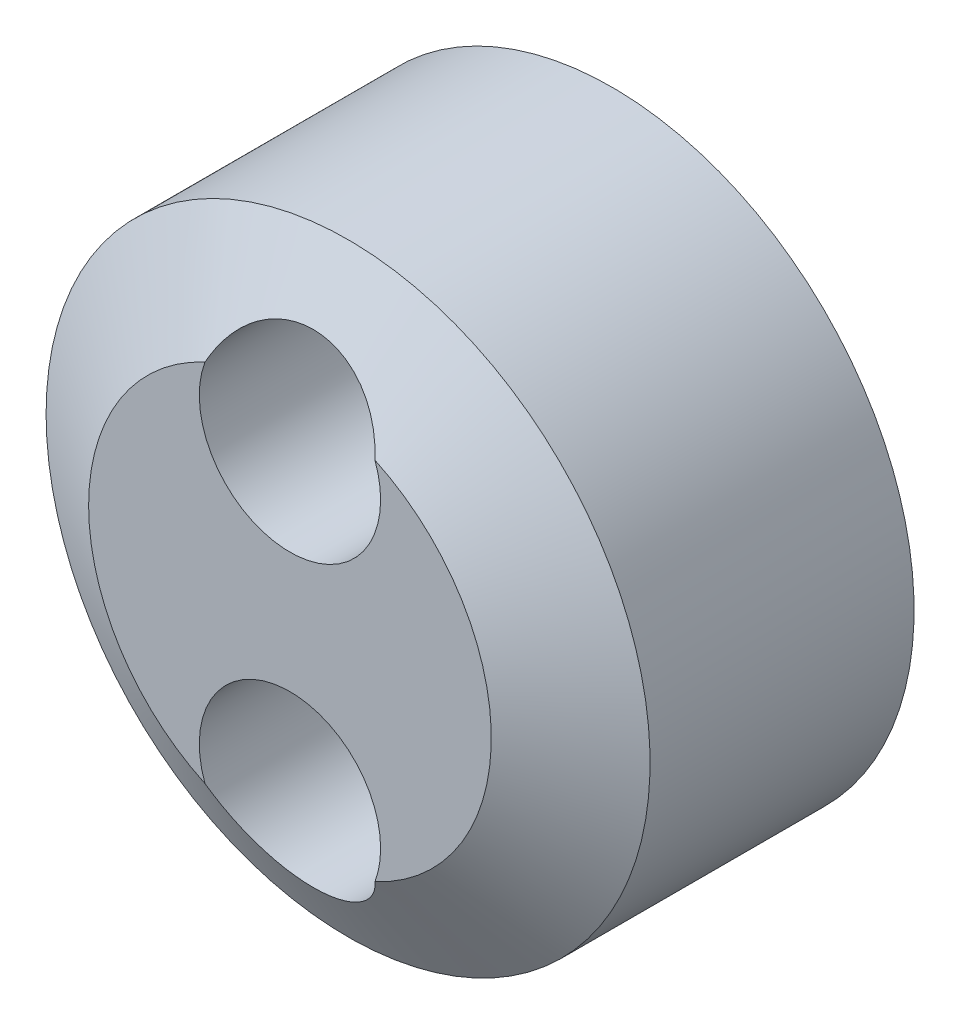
ISO-10303-21;
HEADER;
FILE_DESCRIPTION(('STEP AP214'),'2;1');
FILE_NAME('part.step','',(''),(''),'','','');
FILE_SCHEMA(('AUTOMOTIVE_DESIGN { 1 0 10303 214 1 1 1 1 }'));
ENDSEC;
DATA;
#1=APPLICATION_CONTEXT('core data for automotive mechanical design processes');
#2=APPLICATION_PROTOCOL_DEFINITION('international standard','automotive_design',2000,#1);
#3=PRODUCT_CONTEXT('',#1,'mechanical');
#4=PRODUCT('Part','Part','',(#3));
#5=PRODUCT_RELATED_PRODUCT_CATEGORY('part','',(#4));
#6=PRODUCT_DEFINITION_FORMATION('','',#4);
#7=PRODUCT_DEFINITION_CONTEXT('part definition',#1,'design');
#8=PRODUCT_DEFINITION('design','',#6,#7);
#9=PRODUCT_DEFINITION_SHAPE('','',#8);
#10=(LENGTH_UNIT() NAMED_UNIT(*) SI_UNIT(.MILLI.,.METRE.));
#11=(NAMED_UNIT(*) PLANE_ANGLE_UNIT() SI_UNIT($,.RADIAN.));
#12=(NAMED_UNIT(*) SI_UNIT($,.STERADIAN.) SOLID_ANGLE_UNIT());
#13=UNCERTAINTY_MEASURE_WITH_UNIT(LENGTH_MEASURE(1.E-05),#10,'distance_accuracy_value','');
#14=(GEOMETRIC_REPRESENTATION_CONTEXT(3) GLOBAL_UNCERTAINTY_ASSIGNED_CONTEXT((#13)) GLOBAL_UNIT_ASSIGNED_CONTEXT((#10,
#11,#12)) REPRESENTATION_CONTEXT('',''));
#15=CARTESIAN_POINT('',(0.,0.,0.));
#16=DIRECTION('',(0.,0.,1.));
#17=DIRECTION('',(1.,0.,0.));
#18=AXIS2_PLACEMENT_3D('',#15,#16,#17);
#19=CARTESIAN_POINT('',(0.,0.,32.));
#20=DIRECTION('',(0.,0.,-0.999999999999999));
#21=DIRECTION('',(-1.,0.,0.));
#22=AXIS2_PLACEMENT_3D('',#19,#20,#21);
#23=CYLINDRICAL_SURFACE('',#22,30.);
#24=CARTESIAN_POINT('',(0.,0.,26.2264973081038));
#25=DIRECTION('',(0.,0.,0.999999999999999));
#26=DIRECTION('',(1.,0.,0.));
#27=AXIS2_PLACEMENT_3D('',#24,#25,#26);
#28=CIRCLE('',#27,30.);
#29=CARTESIAN_POINT('',(-30.,0.,26.2264973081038));
#30=VERTEX_POINT('',#29);
#31=EDGE_CURVE('E11',#30,#30,#28,.F.);
#32=CARTESIAN_POINT('',(0.,0.,0.));
#33=DIRECTION('',(0.,0.,0.999999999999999));
#34=DIRECTION('',(1.,0.,0.));
#35=AXIS2_PLACEMENT_3D('',#32,#33,#34);
#36=CIRCLE('',#35,30.);
#37=CARTESIAN_POINT('',(-30.,0.,0.));
#38=VERTEX_POINT('',#37);
#39=EDGE_CURVE('E90',#38,#38,#36,.T.);
#40=CARTESIAN_POINT('',(-30.,0.,26.2264973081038));
#41=CARTESIAN_POINT('',(-30.,0.,25.953304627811));
#42=CARTESIAN_POINT('',(-30.,0.,25.6801119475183));
#43=CARTESIAN_POINT('',(-30.,0.,25.1337265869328));
#44=CARTESIAN_POINT('',(-30.,0.,24.86053390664));
#45=CARTESIAN_POINT('',(-30.,0.,24.3141485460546));
#46=CARTESIAN_POINT('',(-30.,0.,24.0409558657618));
#47=CARTESIAN_POINT('',(-30.,0.,23.4945705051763));
#48=CARTESIAN_POINT('',(-30.,0.,23.2213778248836));
#49=CARTESIAN_POINT('',(-30.,0.,22.6749924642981));
#50=CARTESIAN_POINT('',(-30.,0.,22.4017997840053));
#51=CARTESIAN_POINT('',(-30.,0.,21.8554144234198));
#52=CARTESIAN_POINT('',(-30.,0.,21.5822217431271));
#53=CARTESIAN_POINT('',(-30.,0.,21.0358363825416));
#54=CARTESIAN_POINT('',(-30.,0.,20.7626437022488));
#55=CARTESIAN_POINT('',(-30.,0.,20.2162583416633));
#56=CARTESIAN_POINT('',(-30.,0.,19.9430656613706));
#57=CARTESIAN_POINT('',(-30.,0.,19.3966803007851));
#58=CARTESIAN_POINT('',(-30.,0.,19.1234876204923));
#59=CARTESIAN_POINT('',(-30.,0.,18.5771022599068));
#60=CARTESIAN_POINT('',(-30.,0.,18.3039095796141));
#61=CARTESIAN_POINT('',(-30.,0.,17.7575242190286));
#62=CARTESIAN_POINT('',(-30.,0.,17.4843315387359));
#63=CARTESIAN_POINT('',(-30.,0.,16.9379461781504));
#64=CARTESIAN_POINT('',(-30.,0.,16.6647534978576));
#65=CARTESIAN_POINT('',(-30.,0.,16.1183681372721));
#66=CARTESIAN_POINT('',(-30.,0.,15.8451754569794));
#67=CARTESIAN_POINT('',(-30.,0.,15.2987900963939));
#68=CARTESIAN_POINT('',(-30.,0.,15.0255974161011));
#69=CARTESIAN_POINT('',(-30.,0.,14.4792120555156));
#70=CARTESIAN_POINT('',(-30.,0.,14.2060193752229));
#71=CARTESIAN_POINT('',(-30.,0.,13.6596340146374));
#72=CARTESIAN_POINT('',(-30.,0.,13.3864413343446));
#73=CARTESIAN_POINT('',(-30.,0.,12.8400559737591));
#74=CARTESIAN_POINT('',(-30.,0.,12.5668632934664));
#75=CARTESIAN_POINT('',(-30.,0.,12.0204779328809));
#76=CARTESIAN_POINT('',(-30.,0.,11.7472852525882));
#77=CARTESIAN_POINT('',(-30.,0.,11.2008998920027));
#78=CARTESIAN_POINT('',(-30.,0.,10.9277072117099));
#79=CARTESIAN_POINT('',(-30.,0.,10.3813218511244));
#80=CARTESIAN_POINT('',(-30.,0.,10.1081291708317));
#81=CARTESIAN_POINT('',(-30.,0.,9.56174381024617));
#82=CARTESIAN_POINT('',(-30.,0.,9.28855112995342));
#83=CARTESIAN_POINT('',(-30.,0.,8.74216576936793));
#84=CARTESIAN_POINT('',(-30.,0.,8.46897308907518));
#85=CARTESIAN_POINT('',(-30.,0.,7.92258772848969));
#86=CARTESIAN_POINT('',(-30.,0.,7.64939504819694));
#87=CARTESIAN_POINT('',(-30.,0.,7.10300968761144));
#88=CARTESIAN_POINT('',(-30.,0.,6.82981700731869));
#89=CARTESIAN_POINT('',(-30.,0.,6.2834316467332));
#90=CARTESIAN_POINT('',(-30.,0.,6.01023896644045));
#91=CARTESIAN_POINT('',(-30.,0.,5.46385360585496));
#92=CARTESIAN_POINT('',(-30.,0.,5.19066092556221));
#93=CARTESIAN_POINT('',(-30.,0.,4.64427556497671));
#94=CARTESIAN_POINT('',(-30.,0.,4.37108288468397));
#95=CARTESIAN_POINT('',(-30.,0.,3.82469752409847));
#96=CARTESIAN_POINT('',(-30.,0.,3.55150484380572));
#97=CARTESIAN_POINT('',(-30.,0.,3.00511948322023));
#98=CARTESIAN_POINT('',(-30.,0.,2.73192680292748));
#99=CARTESIAN_POINT('',(-30.,0.,2.18554144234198));
#100=CARTESIAN_POINT('',(-30.,0.,1.91234876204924));
#101=CARTESIAN_POINT('',(-30.,0.,1.36596340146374));
#102=CARTESIAN_POINT('',(-30.,0.,1.092770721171));
#103=CARTESIAN_POINT('',(-30.,0.,0.546385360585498));
#104=CARTESIAN_POINT('',(-30.,0.,0.273192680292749));
#105=CARTESIAN_POINT('',(-30.,0.,0.));
#106=B_SPLINE_CURVE_WITH_KNOTS('',3,(#40,#41,#42,#43,#44,#45,#46,#47,#48,#49,#50,#51,#52,#53,
#54,#55,#56,#57,#58,#59,#60,#61,#62,#63,#64,#65,#66,#67,#68,#69,#70,#71,#72,#73,#74,#75,#76,#77,
#78,#79,#80,#81,#82,#83,#84,#85,#86,#87,#88,#89,#90,#91,#92,#93,#94,#95,#96,#97,#98,#99,#100,
#101,#102,#103,#104,#105),.UNSPECIFIED.,.F.,.F.,(4,2,2,2,2,2,2,2,2,2,2,2,2,2,2,2,2,2,2,2,2,2,2,
2,2,2,2,2,2,2,2,2,4),(0.,0.819578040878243,1.63915608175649,2.45873412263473,3.27831216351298,
4.09789020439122,4.91746824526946,5.7370462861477,6.55662432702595,7.37620236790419,
8.19578040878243,9.01535844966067,9.83493649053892,10.6545145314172,11.4740925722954,
12.2936706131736,13.1132486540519,13.9328266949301,14.7524047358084,15.5719827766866,
16.3915608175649,17.2111388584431,18.0307168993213,18.8502949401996,19.6698729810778,
20.4894510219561,21.3090290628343,22.1286071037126,22.9481851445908,23.7677631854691,
24.5873412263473,25.4069192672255,26.2264973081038),.UNSPECIFIED.);
#107=EDGE_CURVE('BSEAM34',#30,#38,#106,.T.);
#108=ORIENTED_EDGE('',*,*,#31,.T.);
#109=ORIENTED_EDGE('',*,*,#39,.T.);
#110=ORIENTED_EDGE('',*,*,#107,.T.);
#111=ORIENTED_EDGE('',*,*,#107,.F.);
#112=EDGE_LOOP('',(#108,#110,#109,#111));
#113=FACE_BOUND('',#112,.T.);
#114=ADVANCED_FACE('F34',(#113),#23,.T.);
#115=CARTESIAN_POINT('',(0.,0.,32.));
#116=DIRECTION('',(0.,0.,0.999999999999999));
#117=DIRECTION('',(1.,0.,0.));
#118=AXIS2_PLACEMENT_3D('',#115,#116,#117);
#119=PLANE('',#118);
#120=CARTESIAN_POINT('',(-3.5527136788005E-12,-14.9999999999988,32.));
#121=DIRECTION('',(0.,0.,0.999999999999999));
#122=DIRECTION('',(1.,0.,0.));
#123=AXIS2_PLACEMENT_3D('',#120,#121,#122);
#124=CIRCLE('',#123,9.005);
#125=CARTESIAN_POINT('',(8.44340236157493,-18.1303325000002,32.));
#126=VERTEX_POINT('',#125);
#127=CARTESIAN_POINT('',(-8.44340236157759,-18.1303324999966,32.));
#128=VERTEX_POINT('',#127);
#129=EDGE_CURVE('E70',#126,#128,#124,.T.);
#130=ORIENTED_EDGE('',*,*,#129,.F.);
#131=CARTESIAN_POINT('',(0.,0.,32.));
#132=DIRECTION('',(0.,0.,0.999999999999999));
#133=DIRECTION('',(1.,0.,0.));
#134=AXIS2_PLACEMENT_3D('',#131,#132,#133);
#135=CIRCLE('',#134,19.9999999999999);
#136=CARTESIAN_POINT('',(8.44340236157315,18.1303325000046,32.));
#137=VERTEX_POINT('',#136);
#138=EDGE_CURVE('E64',#126,#137,#135,.T.);
#139=ORIENTED_EDGE('',*,*,#138,.T.);
#140=CARTESIAN_POINT('',(0.,15.0000000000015,32.));
#141=DIRECTION('',(0.,0.,0.999999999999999));
#142=DIRECTION('',(1.,0.,0.));
#143=AXIS2_PLACEMENT_3D('',#140,#141,#142);
#144=CIRCLE('',#143,9.005);
#145=CARTESIAN_POINT('',(-8.4434023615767,18.1303325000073,32.));
#146=VERTEX_POINT('',#145);
#147=EDGE_CURVE('E69',#146,#137,#144,.T.);
#148=ORIENTED_EDGE('',*,*,#147,.F.);
#149=CARTESIAN_POINT('',(0.,0.,32.));
#150=DIRECTION('',(0.,0.,0.999999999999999));
#151=DIRECTION('',(1.,0.,0.));
#152=AXIS2_PLACEMENT_3D('',#149,#150,#151);
#153=CIRCLE('',#152,19.9999999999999);
#154=EDGE_CURVE('E53',#146,#128,#153,.T.);
#155=ORIENTED_EDGE('',*,*,#154,.T.);
#156=EDGE_LOOP('',(#130,#139,#148,#155));
#157=FACE_BOUND('',#156,.T.);
#158=ADVANCED_FACE('F68',(#157),#119,.T.);
#159=CARTESIAN_POINT('',(0.,0.,0.));
#160=DIRECTION('',(0.,0.,0.999999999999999));
#161=DIRECTION('',(1.,0.,0.));
#162=AXIS2_PLACEMENT_3D('',#159,#160,#161);
#163=PLANE('',#162);
#164=CARTESIAN_POINT('',(0.,15.0000000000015,0.));
#165=DIRECTION('',(0.,0.,0.999999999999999));
#166=DIRECTION('',(1.,0.,0.));
#167=AXIS2_PLACEMENT_3D('',#164,#165,#166);
#168=CIRCLE('',#167,4.49999999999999);
#169=CARTESIAN_POINT('',(4.5,15.0000000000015,0.));
#170=VERTEX_POINT('',#169);
#171=EDGE_CURVE('E150',#170,#170,#168,.T.);
#172=ORIENTED_EDGE('',*,*,#171,.T.);
#173=EDGE_LOOP('',(#172));
#174=FACE_BOUND('',#173,.T.);
#175=CARTESIAN_POINT('',(-3.5527136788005E-12,-14.9999999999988,0.));
#176=DIRECTION('',(0.,0.,0.999999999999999));
#177=DIRECTION('',(1.,0.,0.));
#178=AXIS2_PLACEMENT_3D('',#175,#176,#177);
#179=CIRCLE('',#178,4.49999999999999);
#180=CARTESIAN_POINT('',(4.49999999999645,-14.9999999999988,0.));
#181=VERTEX_POINT('',#180);
#182=EDGE_CURVE('E73',#181,#181,#179,.T.);
#183=ORIENTED_EDGE('',*,*,#182,.T.);
#184=EDGE_LOOP('',(#183));
#185=FACE_BOUND('',#184,.T.);
#186=ORIENTED_EDGE('',*,*,#39,.F.);
#187=EDGE_LOOP('',(#186));
#188=FACE_BOUND('',#187,.T.);
#189=ADVANCED_FACE('F121',(#174,#185,#188),#163,.F.);
#190=CARTESIAN_POINT('',(-3.5527136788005E-12,-14.9999999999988,32.));
#191=DIRECTION('',(0.,0.,0.999999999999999));
#192=DIRECTION('',(1.,0.,0.));
#193=AXIS2_PLACEMENT_3D('',#190,#191,#192);
#194=CYLINDRICAL_SURFACE('',#193,9.005);
#195=CARTESIAN_POINT('',(-3.5527136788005E-12,-14.9999999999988,10.));
#196=DIRECTION('',(0.,0.,0.999999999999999));
#197=DIRECTION('',(1.,0.,0.));
#198=AXIS2_PLACEMENT_3D('',#195,#196,#197);
#199=CIRCLE('',#198,9.005);
#200=CARTESIAN_POINT('',(9.00499999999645,-14.9999999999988,10.));
#201=VERTEX_POINT('',#200);
#202=EDGE_CURVE('E86',#201,#201,#199,.T.);
#203=ORIENTED_EDGE('',*,*,#202,.F.);
#204=EDGE_LOOP('',(#203));
#205=FACE_BOUND('',#204,.T.);
#206=ORIENTED_EDGE('',*,*,#129,.T.);
#207=CARTESIAN_POINT('',(-8.44340236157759,-18.1303324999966,32.));
#208=CARTESIAN_POINT('',(-8.35651866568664,-18.3647595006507,31.8984873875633));
#209=CARTESIAN_POINT('',(-8.25945803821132,-18.5965321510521,31.7994683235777));
#210=CARTESIAN_POINT('',(-8.04528145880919,-19.0530148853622,31.6067613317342));
#211=CARTESIAN_POINT('',(-7.92815906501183,-19.2777226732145,31.513075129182));
#212=CARTESIAN_POINT('',(-7.67393210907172,-19.7186572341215,31.3312422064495));
#213=CARTESIAN_POINT('',(-7.53678378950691,-19.9348640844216,31.243108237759));
#214=CARTESIAN_POINT('',(-7.2432906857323,-20.356369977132,31.0729947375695));
#215=CARTESIAN_POINT('',(-7.08694803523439,-20.5616702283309,30.9910145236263));
#216=CARTESIAN_POINT('',(-6.75541242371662,-20.9600118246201,30.833376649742));
#217=CARTESIAN_POINT('',(-6.5801738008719,-21.1530215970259,30.7577351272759));
#218=CARTESIAN_POINT('',(-6.21216689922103,-21.5243645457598,30.6133723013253));
#219=CARTESIAN_POINT('',(-6.01939918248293,-21.7026981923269,30.5446507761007));
#220=CARTESIAN_POINT('',(-5.61779350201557,-22.0426954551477,30.4145574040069));
#221=CARTESIAN_POINT('',(-5.40897500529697,-22.2043787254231,30.3531768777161));
#222=CARTESIAN_POINT('',(-4.97652117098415,-22.5096135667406,30.2380061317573));
#223=CARTESIAN_POINT('',(-4.75288681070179,-22.6531663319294,30.1842154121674));
#224=CARTESIAN_POINT('',(-4.30482702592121,-22.9134043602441,30.0872031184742));
#225=CARTESIAN_POINT('',(-4.08108748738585,-23.0311177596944,30.0435693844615));
#226=CARTESIAN_POINT('',(-3.62342688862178,-23.2477199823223,29.9636034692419));
#227=CARTESIAN_POINT('',(-3.38950641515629,-23.3466098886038,29.927270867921));
#228=CARTESIAN_POINT('',(-2.91318852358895,-23.524552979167,29.8621012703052));
#229=CARTESIAN_POINT('',(-2.67078998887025,-23.6036035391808,29.8332652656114));
#230=CARTESIAN_POINT('',(-2.1794248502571,-23.7410070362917,29.7832593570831));
#231=CARTESIAN_POINT('',(-1.9304584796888,-23.7993607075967,29.7620891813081));
#232=CARTESIAN_POINT('',(-1.44064117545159,-23.8923309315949,29.7284097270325));
#233=CARTESIAN_POINT('',(-1.20001525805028,-23.9279973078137,29.7155170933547));
#234=CARTESIAN_POINT('',(-0.716401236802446,-23.9797509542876,29.6968210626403));
#235=CARTESIAN_POINT('',(-0.473413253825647,-23.9958392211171,29.6910173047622));
#236=CARTESIAN_POINT('',(0.0130723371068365,-24.0082765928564,29.6865299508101));
#237=CARTESIAN_POINT('',(0.256569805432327,-24.0046305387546,29.6878446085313));
#238=CARTESIAN_POINT('',(0.742328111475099,-23.9776469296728,29.6975829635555));
#239=CARTESIAN_POINT('',(0.984588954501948,-23.9543094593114,29.7060066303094));
#240=CARTESIAN_POINT('',(1.46124068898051,-23.8888416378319,29.7296770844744));
#241=CARTESIAN_POINT('',(1.69569188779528,-23.8470984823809,29.7447833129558));
#242=CARTESIAN_POINT('',(2.16004701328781,-23.7453253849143,29.7817010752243));
#243=CARTESIAN_POINT('',(2.38995102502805,-23.6852957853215,29.8035124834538));
#244=CARTESIAN_POINT('',(2.84364129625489,-23.5475104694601,29.8537317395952));
#245=CARTESIAN_POINT('',(3.06742755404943,-23.4697547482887,29.8821395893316));
#246=CARTESIAN_POINT('',(3.50739751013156,-23.2972299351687,29.9454132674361));
#247=CARTESIAN_POINT('',(3.72358110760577,-23.2024606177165,29.9802791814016));
#248=CARTESIAN_POINT('',(4.14946468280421,-22.9955410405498,30.0567534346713));
#249=CARTESIAN_POINT('',(4.35905775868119,-22.8831984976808,30.0984366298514));
#250=CARTESIAN_POINT('',(4.7677297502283,-22.6429681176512,30.1880497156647));
#251=CARTESIAN_POINT('',(4.96680858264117,-22.5150801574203,30.2359796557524));
#252=CARTESIAN_POINT('',(5.35327621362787,-22.2448639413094,30.3378705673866));
#253=CARTESIAN_POINT('',(5.54066484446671,-22.102535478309,30.3918316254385));
#254=CARTESIAN_POINT('',(5.90278958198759,-21.8045652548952,30.5055753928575));
#255=CARTESIAN_POINT('',(6.07752000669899,-21.6489175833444,30.5653606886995));
#256=CARTESIAN_POINT('',(6.42018742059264,-21.3190236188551,30.6930377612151));
#257=CARTESIAN_POINT('',(6.58755760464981,-21.1442779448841,30.7611605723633));
#258=CARTESIAN_POINT('',(6.90661596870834,-20.7833110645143,30.9031075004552));
#259=CARTESIAN_POINT('',(7.05830988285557,-20.5970940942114,30.9769295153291));
#260=CARTESIAN_POINT('',(7.3453679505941,-20.2146663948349,31.1299797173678));
#261=CARTESIAN_POINT('',(7.48073635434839,-20.018458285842,31.2092064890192));
#262=CARTESIAN_POINT('',(7.73462694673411,-19.617558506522,31.3727588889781));
#263=CARTESIAN_POINT('',(7.85315471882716,-19.4128696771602,31.4570828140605));
#264=CARTESIAN_POINT('',(8.05542262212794,-19.0298009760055,31.6166523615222));
#265=CARTESIAN_POINT('',(8.14169415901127,-18.8524555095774,31.6911900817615));
#266=CARTESIAN_POINT('',(8.30181264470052,-18.4940527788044,31.8433173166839));
#267=CARTESIAN_POINT('',(8.37568656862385,-18.3130045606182,31.9208997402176));
#268=CARTESIAN_POINT('',(8.44340236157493,-18.1303325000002,32.));
#269=B_SPLINE_CURVE_WITH_KNOTS('',3,(#207,#208,#209,#210,#211,#212,#213,#214,#215,#216,#217,
#218,#219,#220,#221,#222,#223,#224,#225,#226,#227,#228,#229,#230,#231,#232,#233,#234,#235,#236,
#237,#238,#239,#240,#241,#242,#243,#244,#245,#246,#247,#248,#249,#250,#251,#252,#253,#254,#255,
#256,#257,#258,#259,#260,#261,#262,#263,#264,#265,#266,#267,#268),.UNSPECIFIED.,.F.,.F.,(4,2,2,
2,2,2,2,2,2,2,2,2,2,2,2,2,2,2,2,2,2,2,2,2,2,2,2,2,2,2,4),(0.,0.809332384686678,1.61892513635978,
2.43031411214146,3.24161297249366,4.05491822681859,4.86819741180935,5.68050532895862,
6.49275971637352,7.26144473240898,8.03008550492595,8.79882789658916,9.56754301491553,
10.2974416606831,11.0273031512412,11.7569856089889,12.4866649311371,13.2016765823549,
13.9166748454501,14.6316733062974,15.346681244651,16.0701443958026,16.7936132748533,
17.5170925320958,18.2408945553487,18.9941853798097,19.7471996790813,20.5000175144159,
21.2525851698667,21.8846689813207,22.5153591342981),.UNSPECIFIED.);
#270=EDGE_CURVE('E41',#128,#126,#269,.T.);
#271=ORIENTED_EDGE('',*,*,#270,.T.);
#272=EDGE_LOOP('',(#206,#271));
#273=FACE_BOUND('',#272,.T.);
#274=ADVANCED_FACE('F116',(#205,#273),#194,.F.);
#275=CARTESIAN_POINT('',(4.49999999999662,-14.9999999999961,10.));
#276=DIRECTION('',(0.,0.,-0.999999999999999));
#277=DIRECTION('',(-1.,0.,0.));
#278=AXIS2_PLACEMENT_3D('',#275,#276,#277);
#279=PLANE('',#278);
#280=CARTESIAN_POINT('',(-3.5527136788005E-12,-14.9999999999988,10.));
#281=DIRECTION('',(0.,0.,0.999999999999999));
#282=DIRECTION('',(1.,0.,0.));
#283=AXIS2_PLACEMENT_3D('',#280,#281,#282);
#284=CIRCLE('',#283,4.5);
#285=CARTESIAN_POINT('',(4.49999999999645,-14.9999999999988,10.));
#286=VERTEX_POINT('',#285);
#287=EDGE_CURVE('E77',#286,#286,#284,.T.);
#288=ORIENTED_EDGE('',*,*,#287,.F.);
#289=EDGE_LOOP('',(#288));
#290=FACE_BOUND('',#289,.T.);
#291=ORIENTED_EDGE('',*,*,#202,.T.);
#292=EDGE_LOOP('',(#291));
#293=FACE_BOUND('',#292,.T.);
#294=ADVANCED_FACE('F113',(#290,#293),#279,.F.);
#295=CARTESIAN_POINT('',(-3.5527136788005E-12,-14.9999999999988,32.));
#296=DIRECTION('',(0.,0.,0.999999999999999));
#297=DIRECTION('',(1.,0.,0.));
#298=AXIS2_PLACEMENT_3D('',#295,#296,#297);
#299=CYLINDRICAL_SURFACE('',#298,4.49999999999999);
#300=CARTESIAN_POINT('',(4.49999999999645,-14.9999999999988,0.));
#301=CARTESIAN_POINT('',(4.49999999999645,-14.9999999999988,0.104166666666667));
#302=CARTESIAN_POINT('',(4.49999999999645,-14.9999999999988,0.208333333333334));
#303=CARTESIAN_POINT('',(4.49999999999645,-14.9999999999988,0.416666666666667));
#304=CARTESIAN_POINT('',(4.49999999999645,-14.9999999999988,0.520833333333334));
#305=CARTESIAN_POINT('',(4.49999999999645,-14.9999999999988,0.729166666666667));
#306=CARTESIAN_POINT('',(4.49999999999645,-14.9999999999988,0.833333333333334));
#307=CARTESIAN_POINT('',(4.49999999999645,-14.9999999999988,1.04166666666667));
#308=CARTESIAN_POINT('',(4.49999999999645,-14.9999999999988,1.14583333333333));
#309=CARTESIAN_POINT('',(4.49999999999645,-14.9999999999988,1.35416666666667));
#310=CARTESIAN_POINT('',(4.49999999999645,-14.9999999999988,1.45833333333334));
#311=CARTESIAN_POINT('',(4.49999999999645,-14.9999999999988,1.66666666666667));
#312=CARTESIAN_POINT('',(4.49999999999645,-14.9999999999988,1.77083333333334));
#313=CARTESIAN_POINT('',(4.49999999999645,-14.9999999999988,1.97916666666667));
#314=CARTESIAN_POINT('',(4.49999999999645,-14.9999999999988,2.08333333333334));
#315=CARTESIAN_POINT('',(4.49999999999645,-14.9999999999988,2.29166666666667));
#316=CARTESIAN_POINT('',(4.49999999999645,-14.9999999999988,2.39583333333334));
#317=CARTESIAN_POINT('',(4.49999999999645,-14.9999999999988,2.60416666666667));
#318=CARTESIAN_POINT('',(4.49999999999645,-14.9999999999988,2.70833333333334));
#319=CARTESIAN_POINT('',(4.49999999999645,-14.9999999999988,2.91666666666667));
#320=CARTESIAN_POINT('',(4.49999999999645,-14.9999999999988,3.02083333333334));
#321=CARTESIAN_POINT('',(4.49999999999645,-14.9999999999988,3.22916666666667));
#322=CARTESIAN_POINT('',(4.49999999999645,-14.9999999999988,3.33333333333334));
#323=CARTESIAN_POINT('',(4.49999999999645,-14.9999999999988,3.54166666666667));
#324=CARTESIAN_POINT('',(4.49999999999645,-14.9999999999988,3.64583333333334));
#325=CARTESIAN_POINT('',(4.49999999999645,-14.9999999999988,3.85416666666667));
#326=CARTESIAN_POINT('',(4.49999999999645,-14.9999999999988,3.95833333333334));
#327=CARTESIAN_POINT('',(4.49999999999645,-14.9999999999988,4.16666666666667));
#328=CARTESIAN_POINT('',(4.49999999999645,-14.9999999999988,4.27083333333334));
#329=CARTESIAN_POINT('',(4.49999999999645,-14.9999999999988,4.47916666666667));
#330=CARTESIAN_POINT('',(4.49999999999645,-14.9999999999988,4.58333333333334));
#331=CARTESIAN_POINT('',(4.49999999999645,-14.9999999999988,4.79166666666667));
#332=CARTESIAN_POINT('',(4.49999999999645,-14.9999999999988,4.89583333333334));
#333=CARTESIAN_POINT('',(4.49999999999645,-14.9999999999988,5.10416666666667));
#334=CARTESIAN_POINT('',(4.49999999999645,-14.9999999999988,5.20833333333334));
#335=CARTESIAN_POINT('',(4.49999999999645,-14.9999999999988,5.41666666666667));
#336=CARTESIAN_POINT('',(4.49999999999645,-14.9999999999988,5.52083333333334));
#337=CARTESIAN_POINT('',(4.49999999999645,-14.9999999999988,5.72916666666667));
#338=CARTESIAN_POINT('',(4.49999999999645,-14.9999999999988,5.83333333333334));
#339=CARTESIAN_POINT('',(4.49999999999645,-14.9999999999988,6.04166666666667));
#340=CARTESIAN_POINT('',(4.49999999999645,-14.9999999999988,6.14583333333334));
#341=CARTESIAN_POINT('',(4.49999999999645,-14.9999999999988,6.35416666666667));
#342=CARTESIAN_POINT('',(4.49999999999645,-14.9999999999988,6.45833333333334));
#343=CARTESIAN_POINT('',(4.49999999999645,-14.9999999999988,6.66666666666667));
#344=CARTESIAN_POINT('',(4.49999999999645,-14.9999999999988,6.77083333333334));
#345=CARTESIAN_POINT('',(4.49999999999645,-14.9999999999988,6.97916666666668));
#346=CARTESIAN_POINT('',(4.49999999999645,-14.9999999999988,7.08333333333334));
#347=CARTESIAN_POINT('',(4.49999999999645,-14.9999999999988,7.29166666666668));
#348=CARTESIAN_POINT('',(4.49999999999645,-14.9999999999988,7.39583333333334));
#349=CARTESIAN_POINT('',(4.49999999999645,-14.9999999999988,7.60416666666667));
#350=CARTESIAN_POINT('',(4.49999999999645,-14.9999999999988,7.70833333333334));
#351=CARTESIAN_POINT('',(4.49999999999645,-14.9999999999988,7.91666666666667));
#352=CARTESIAN_POINT('',(4.49999999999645,-14.9999999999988,8.02083333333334));
#353=CARTESIAN_POINT('',(4.49999999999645,-14.9999999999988,8.22916666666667));
#354=CARTESIAN_POINT('',(4.49999999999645,-14.9999999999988,8.33333333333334));
#355=CARTESIAN_POINT('',(4.49999999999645,-14.9999999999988,8.54166666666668));
#356=CARTESIAN_POINT('',(4.49999999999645,-14.9999999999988,8.64583333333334));
#357=CARTESIAN_POINT('',(4.49999999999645,-14.9999999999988,8.85416666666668));
#358=CARTESIAN_POINT('',(4.49999999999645,-14.9999999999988,8.95833333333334));
#359=CARTESIAN_POINT('',(4.49999999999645,-14.9999999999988,9.16666666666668));
#360=CARTESIAN_POINT('',(4.49999999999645,-14.9999999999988,9.27083333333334));
#361=CARTESIAN_POINT('',(4.49999999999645,-14.9999999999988,9.47916666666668));
#362=CARTESIAN_POINT('',(4.49999999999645,-14.9999999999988,9.58333333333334));
#363=CARTESIAN_POINT('',(4.49999999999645,-14.9999999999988,9.79166666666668));
#364=CARTESIAN_POINT('',(4.49999999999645,-14.9999999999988,9.89583333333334));
#365=CARTESIAN_POINT('',(4.49999999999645,-14.9999999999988,10.));
#366=B_SPLINE_CURVE_WITH_KNOTS('',3,(#300,#301,#302,#303,#304,#305,#306,#307,#308,#309,#310,
#311,#312,#313,#314,#315,#316,#317,#318,#319,#320,#321,#322,#323,#324,#325,#326,#327,#328,#329,
#330,#331,#332,#333,#334,#335,#336,#337,#338,#339,#340,#341,#342,#343,#344,#345,#346,#347,#348,
#349,#350,#351,#352,#353,#354,#355,#356,#357,#358,#359,#360,#361,#362,#363,#364,#365),
.UNSPECIFIED.,.F.,.F.,(4,2,2,2,2,2,2,2,2,2,2,2,2,2,2,2,2,2,2,2,2,2,2,2,2,2,2,2,2,2,2,2,4),(0.,
0.3125,0.625000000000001,0.937500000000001,1.25,1.5625,1.87500000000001,2.1875,2.5,2.8125,3.125,
3.4375,3.75000000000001,4.06250000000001,4.37500000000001,4.6875,5.,5.3125,5.62500000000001,
5.93750000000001,6.25000000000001,6.56250000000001,6.87500000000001,7.18750000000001,
7.50000000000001,7.81250000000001,8.12500000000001,8.43750000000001,8.75000000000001,
9.06250000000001,9.37500000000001,9.68750000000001,10.),.UNSPECIFIED.);
#367=EDGE_CURVE('BSEAM109',#181,#286,#366,.T.);
#368=ORIENTED_EDGE('',*,*,#182,.F.);
#369=ORIENTED_EDGE('',*,*,#287,.T.);
#370=ORIENTED_EDGE('',*,*,#367,.T.);
#371=ORIENTED_EDGE('',*,*,#367,.F.);
#372=EDGE_LOOP('',(#368,#370,#369,#371));
#373=FACE_BOUND('',#372,.T.);
#374=ADVANCED_FACE('F109',(#373),#299,.F.);
#375=CARTESIAN_POINT('',(0.,15.0000000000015,32.));
#376=DIRECTION('',(0.,0.,0.999999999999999));
#377=DIRECTION('',(1.,0.,0.));
#378=AXIS2_PLACEMENT_3D('',#375,#376,#377);
#379=CYLINDRICAL_SURFACE('',#378,9.005);
#380=CARTESIAN_POINT('',(0.,15.0000000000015,10.));
#381=DIRECTION('',(0.,0.,0.999999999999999));
#382=DIRECTION('',(1.,0.,0.));
#383=AXIS2_PLACEMENT_3D('',#380,#381,#382);
#384=CIRCLE('',#383,9.005);
#385=CARTESIAN_POINT('',(9.005,15.0000000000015,10.));
#386=VERTEX_POINT('',#385);
#387=EDGE_CURVE('E74',#386,#386,#384,.T.);
#388=ORIENTED_EDGE('',*,*,#387,.F.);
#389=EDGE_LOOP('',(#388));
#390=FACE_BOUND('',#389,.T.);
#391=ORIENTED_EDGE('',*,*,#147,.T.);
#392=CARTESIAN_POINT('',(8.44340236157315,18.1303325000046,32.));
#393=CARTESIAN_POINT('',(8.35651866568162,18.3647595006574,31.8984873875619));
#394=CARTESIAN_POINT('',(8.25945803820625,18.5965321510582,31.7994683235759));
#395=CARTESIAN_POINT('',(8.04528145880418,19.0530148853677,31.6067613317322));
#396=CARTESIAN_POINT('',(7.92815906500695,19.2777226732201,31.5130751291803));
#397=CARTESIAN_POINT('',(7.67393210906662,19.7186572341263,31.3312422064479));
#398=CARTESIAN_POINT('',(7.53678378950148,19.9348640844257,31.2431082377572));
#399=CARTESIAN_POINT('',(7.24329068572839,20.3563699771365,31.0729947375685));
#400=CARTESIAN_POINT('',(7.08694803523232,20.5616702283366,30.9910145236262));
#401=CARTESIAN_POINT('',(6.75541242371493,20.9600118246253,30.833376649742));
#402=CARTESIAN_POINT('',(6.58017380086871,21.1530215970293,30.7577351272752));
#403=CARTESIAN_POINT('',(6.21216689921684,21.524364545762,30.6133723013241));
#404=CARTESIAN_POINT('',(6.01939918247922,21.7026981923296,30.5446507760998));
#405=CARTESIAN_POINT('',(5.61779350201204,22.0426954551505,30.4145574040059));
#406=CARTESIAN_POINT('',(5.40897500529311,22.2043787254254,30.3531768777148));
#407=CARTESIAN_POINT('',(4.97652117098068,22.5096135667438,30.2380061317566));
#408=CARTESIAN_POINT('',(4.75288681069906,22.6531663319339,30.1842154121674));
#409=CARTESIAN_POINT('',(4.30482702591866,22.9134043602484,30.0872031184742));
#410=CARTESIAN_POINT('',(4.08108748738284,23.0311177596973,30.0435693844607));
#411=CARTESIAN_POINT('',(3.6234268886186,23.2477199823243,29.9636034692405));
#412=CARTESIAN_POINT('',(3.38950641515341,23.3466098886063,29.9272708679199));
#413=CARTESIAN_POINT('',(2.91318852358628,23.5245529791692,29.862101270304));
#414=CARTESIAN_POINT('',(2.67078998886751,23.6036035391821,29.8332652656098));
#415=CARTESIAN_POINT('',(2.17942485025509,23.7410070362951,29.7832593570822));
#416=CARTESIAN_POINT('',(1.9304584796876,23.799360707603,29.7620891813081));
#417=CARTESIAN_POINT('',(1.44064117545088,23.8923309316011,29.7284097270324));
#418=CARTESIAN_POINT('',(1.20001525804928,23.927997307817,29.7155170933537));
#419=CARTESIAN_POINT('',(0.716401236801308,23.979750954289,29.6968210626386));
#420=CARTESIAN_POINT('',(0.47341325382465,23.9958392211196,29.6910173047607));
#421=CARTESIAN_POINT('',(-0.0130723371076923,24.0082765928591,29.6865299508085));
#422=CARTESIAN_POINT('',(-0.256569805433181,24.0046305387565,29.6878446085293));
#423=CARTESIAN_POINT('',(-0.742328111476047,23.9776469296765,29.6975829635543));
#424=CARTESIAN_POINT('',(-0.984588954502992,23.9543094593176,29.7060066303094));
#425=CARTESIAN_POINT('',(-1.46124068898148,23.8888416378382,29.7296770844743));
#426=CARTESIAN_POINT('',(-1.6956918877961,23.8470984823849,29.7447833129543));
#427=CARTESIAN_POINT('',(-2.16004701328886,23.7453253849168,29.781701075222));
#428=CARTESIAN_POINT('',(-2.38995102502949,23.6852957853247,29.8035124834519));
#429=CARTESIAN_POINT('',(-2.8436412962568,23.5475104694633,29.8537317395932));
#430=CARTESIAN_POINT('',(-3.06742755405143,23.4697547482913,29.8821395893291));
#431=CARTESIAN_POINT('',(-3.50739751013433,23.2972299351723,29.9454132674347));
#432=CARTESIAN_POINT('',(-3.72358110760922,23.2024606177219,29.9802791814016));
#433=CARTESIAN_POINT('',(-4.14946468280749,22.9955410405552,30.0567534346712));
#434=CARTESIAN_POINT('',(-4.35905775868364,22.8831984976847,30.0984366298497));
#435=CARTESIAN_POINT('',(-4.76772975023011,22.6429681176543,30.1880497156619));
#436=CARTESIAN_POINT('',(-4.96680858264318,22.5150801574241,30.2359796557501));
#437=CARTESIAN_POINT('',(-5.35327621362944,22.2448639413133,30.337870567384));
#438=CARTESIAN_POINT('',(-5.54066484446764,22.1025354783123,30.3918316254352));
#439=CARTESIAN_POINT('',(-5.90278958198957,21.8045652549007,30.5055753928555));
#440=CARTESIAN_POINT('',(-6.07752000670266,21.648917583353,30.5653606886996));
#441=CARTESIAN_POINT('',(-6.42018742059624,21.3190236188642,30.6930377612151));
#442=CARTESIAN_POINT('',(-6.58755760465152,21.1442779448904,30.761160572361));
#443=CARTESIAN_POINT('',(-6.90661596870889,20.7833110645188,30.9031075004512));
#444=CARTESIAN_POINT('',(-7.05830988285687,20.5970940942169,30.9769295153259));
#445=CARTESIAN_POINT('',(-7.34536795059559,20.2146663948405,31.1299797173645));
#446=CARTESIAN_POINT('',(-7.48073635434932,20.0184582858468,31.2092064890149));
#447=CARTESIAN_POINT('',(-7.73462694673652,19.6175585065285,31.3727588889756));
#448=CARTESIAN_POINT('',(-7.8531547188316,19.412869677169,31.4570828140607));
#449=CARTESIAN_POINT('',(-8.05542262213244,19.0298009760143,31.616652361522));
#450=CARTESIAN_POINT('',(-8.14169415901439,18.8524555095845,31.691190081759));
#451=CARTESIAN_POINT('',(-8.30181264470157,18.4940527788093,31.8433173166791));
#452=CARTESIAN_POINT('',(-8.3756865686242,18.3130045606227,31.9208997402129));
#453=CARTESIAN_POINT('',(-8.4434023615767,18.1303325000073,32.));
#454=B_SPLINE_CURVE_WITH_KNOTS('',3,(#392,#393,#394,#395,#396,#397,#398,#399,#400,#401,#402,
#403,#404,#405,#406,#407,#408,#409,#410,#411,#412,#413,#414,#415,#416,#417,#418,#419,#420,#421,
#422,#423,#424,#425,#426,#427,#428,#429,#430,#431,#432,#433,#434,#435,#436,#437,#438,#439,#440,
#441,#442,#443,#444,#445,#446,#447,#448,#449,#450,#451,#452,#453),.UNSPECIFIED.,.F.,.F.,(4,2,2,
2,2,2,2,2,2,2,2,2,2,2,2,2,2,2,2,2,2,2,2,2,2,2,2,2,2,2,4),(0.,0.809332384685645,1.61892513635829,
2.43031411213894,3.2416129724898,4.0549182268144,4.86819741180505,5.6805053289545,
6.4927597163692,7.26144473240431,8.03008550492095,8.79882789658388,9.5675430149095,
10.2974416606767,11.0273031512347,11.7569856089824,12.4866649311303,13.2016765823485,
13.9166748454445,14.6316733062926,15.3466812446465,16.0701443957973,16.7936132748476,
17.5170925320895,18.2408945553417,18.9941853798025,19.7471996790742,20.5000175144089,
21.2525851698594,21.8846689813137,22.5153591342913),.UNSPECIFIED.);
#455=EDGE_CURVE('E61',#137,#146,#454,.T.);
#456=ORIENTED_EDGE('',*,*,#455,.T.);
#457=EDGE_LOOP('',(#391,#456));
#458=FACE_BOUND('',#457,.T.);
#459=ADVANCED_FACE('F72',(#390,#458),#379,.F.);
#460=CARTESIAN_POINT('',(4.49999999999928,15.000000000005,10.));
#461=DIRECTION('',(0.,0.,-0.999999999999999));
#462=DIRECTION('',(-1.,0.,0.));
#463=AXIS2_PLACEMENT_3D('',#460,#461,#462);
#464=PLANE('',#463);
#465=CARTESIAN_POINT('',(0.,15.0000000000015,10.));
#466=DIRECTION('',(0.,0.,0.999999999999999));
#467=DIRECTION('',(1.,0.,0.));
#468=AXIS2_PLACEMENT_3D('',#465,#466,#467);
#469=CIRCLE('',#468,4.5);
#470=CARTESIAN_POINT('',(4.5,15.0000000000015,10.));
#471=VERTEX_POINT('',#470);
#472=EDGE_CURVE('E80',#471,#471,#469,.T.);
#473=ORIENTED_EDGE('',*,*,#472,.F.);
#474=EDGE_LOOP('',(#473));
#475=FACE_BOUND('',#474,.T.);
#476=ORIENTED_EDGE('',*,*,#387,.T.);
#477=EDGE_LOOP('',(#476));
#478=FACE_BOUND('',#477,.T.);
#479=ADVANCED_FACE('F108',(#475,#478),#464,.F.);
#480=CARTESIAN_POINT('',(0.,15.0000000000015,32.));
#481=DIRECTION('',(0.,0.,0.999999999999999));
#482=DIRECTION('',(1.,0.,0.));
#483=AXIS2_PLACEMENT_3D('',#480,#481,#482);
#484=CYLINDRICAL_SURFACE('',#483,4.49999999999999);
#485=CARTESIAN_POINT('',(4.5,15.0000000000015,0.));
#486=CARTESIAN_POINT('',(4.5,15.0000000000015,0.104166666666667));
#487=CARTESIAN_POINT('',(4.5,15.0000000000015,0.208333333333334));
#488=CARTESIAN_POINT('',(4.5,15.0000000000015,0.416666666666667));
#489=CARTESIAN_POINT('',(4.5,15.0000000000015,0.520833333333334));
#490=CARTESIAN_POINT('',(4.5,15.0000000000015,0.729166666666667));
#491=CARTESIAN_POINT('',(4.5,15.0000000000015,0.833333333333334));
#492=CARTESIAN_POINT('',(4.5,15.0000000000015,1.04166666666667));
#493=CARTESIAN_POINT('',(4.5,15.0000000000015,1.14583333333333));
#494=CARTESIAN_POINT('',(4.5,15.0000000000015,1.35416666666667));
#495=CARTESIAN_POINT('',(4.5,15.0000000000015,1.45833333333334));
#496=CARTESIAN_POINT('',(4.5,15.0000000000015,1.66666666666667));
#497=CARTESIAN_POINT('',(4.5,15.0000000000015,1.77083333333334));
#498=CARTESIAN_POINT('',(4.5,15.0000000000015,1.97916666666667));
#499=CARTESIAN_POINT('',(4.5,15.0000000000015,2.08333333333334));
#500=CARTESIAN_POINT('',(4.5,15.0000000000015,2.29166666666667));
#501=CARTESIAN_POINT('',(4.5,15.0000000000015,2.39583333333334));
#502=CARTESIAN_POINT('',(4.5,15.0000000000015,2.60416666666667));
#503=CARTESIAN_POINT('',(4.5,15.0000000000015,2.70833333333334));
#504=CARTESIAN_POINT('',(4.5,15.0000000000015,2.91666666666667));
#505=CARTESIAN_POINT('',(4.5,15.0000000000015,3.02083333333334));
#506=CARTESIAN_POINT('',(4.5,15.0000000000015,3.22916666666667));
#507=CARTESIAN_POINT('',(4.5,15.0000000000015,3.33333333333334));
#508=CARTESIAN_POINT('',(4.5,15.0000000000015,3.54166666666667));
#509=CARTESIAN_POINT('',(4.5,15.0000000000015,3.64583333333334));
#510=CARTESIAN_POINT('',(4.5,15.0000000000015,3.85416666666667));
#511=CARTESIAN_POINT('',(4.5,15.0000000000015,3.95833333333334));
#512=CARTESIAN_POINT('',(4.5,15.0000000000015,4.16666666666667));
#513=CARTESIAN_POINT('',(4.5,15.0000000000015,4.27083333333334));
#514=CARTESIAN_POINT('',(4.5,15.0000000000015,4.47916666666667));
#515=CARTESIAN_POINT('',(4.5,15.0000000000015,4.58333333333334));
#516=CARTESIAN_POINT('',(4.5,15.0000000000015,4.79166666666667));
#517=CARTESIAN_POINT('',(4.5,15.0000000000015,4.89583333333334));
#518=CARTESIAN_POINT('',(4.5,15.0000000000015,5.10416666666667));
#519=CARTESIAN_POINT('',(4.5,15.0000000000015,5.20833333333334));
#520=CARTESIAN_POINT('',(4.5,15.0000000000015,5.41666666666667));
#521=CARTESIAN_POINT('',(4.5,15.0000000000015,5.52083333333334));
#522=CARTESIAN_POINT('',(4.5,15.0000000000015,5.72916666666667));
#523=CARTESIAN_POINT('',(4.5,15.0000000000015,5.83333333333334));
#524=CARTESIAN_POINT('',(4.5,15.0000000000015,6.04166666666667));
#525=CARTESIAN_POINT('',(4.5,15.0000000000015,6.14583333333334));
#526=CARTESIAN_POINT('',(4.5,15.0000000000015,6.35416666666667));
#527=CARTESIAN_POINT('',(4.5,15.0000000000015,6.45833333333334));
#528=CARTESIAN_POINT('',(4.5,15.0000000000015,6.66666666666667));
#529=CARTESIAN_POINT('',(4.5,15.0000000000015,6.77083333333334));
#530=CARTESIAN_POINT('',(4.5,15.0000000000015,6.97916666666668));
#531=CARTESIAN_POINT('',(4.5,15.0000000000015,7.08333333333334));
#532=CARTESIAN_POINT('',(4.5,15.0000000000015,7.29166666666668));
#533=CARTESIAN_POINT('',(4.5,15.0000000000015,7.39583333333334));
#534=CARTESIAN_POINT('',(4.5,15.0000000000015,7.60416666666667));
#535=CARTESIAN_POINT('',(4.5,15.0000000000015,7.70833333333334));
#536=CARTESIAN_POINT('',(4.5,15.0000000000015,7.91666666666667));
#537=CARTESIAN_POINT('',(4.5,15.0000000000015,8.02083333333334));
#538=CARTESIAN_POINT('',(4.5,15.0000000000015,8.22916666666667));
#539=CARTESIAN_POINT('',(4.5,15.0000000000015,8.33333333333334));
#540=CARTESIAN_POINT('',(4.5,15.0000000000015,8.54166666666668));
#541=CARTESIAN_POINT('',(4.5,15.0000000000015,8.64583333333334));
#542=CARTESIAN_POINT('',(4.5,15.0000000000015,8.85416666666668));
#543=CARTESIAN_POINT('',(4.5,15.0000000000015,8.95833333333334));
#544=CARTESIAN_POINT('',(4.5,15.0000000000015,9.16666666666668));
#545=CARTESIAN_POINT('',(4.5,15.0000000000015,9.27083333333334));
#546=CARTESIAN_POINT('',(4.5,15.0000000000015,9.47916666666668));
#547=CARTESIAN_POINT('',(4.5,15.0000000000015,9.58333333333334));
#548=CARTESIAN_POINT('',(4.5,15.0000000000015,9.79166666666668));
#549=CARTESIAN_POINT('',(4.5,15.0000000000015,9.89583333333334));
#550=CARTESIAN_POINT('',(4.5,15.0000000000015,10.));
#551=B_SPLINE_CURVE_WITH_KNOTS('',3,(#485,#486,#487,#488,#489,#490,#491,#492,#493,#494,#495,
#496,#497,#498,#499,#500,#501,#502,#503,#504,#505,#506,#507,#508,#509,#510,#511,#512,#513,#514,
#515,#516,#517,#518,#519,#520,#521,#522,#523,#524,#525,#526,#527,#528,#529,#530,#531,#532,#533,
#534,#535,#536,#537,#538,#539,#540,#541,#542,#543,#544,#545,#546,#547,#548,#549,#550),
.UNSPECIFIED.,.F.,.F.,(4,2,2,2,2,2,2,2,2,2,2,2,2,2,2,2,2,2,2,2,2,2,2,2,2,2,2,2,2,2,2,2,4),(0.,
0.3125,0.625000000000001,0.937500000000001,1.25,1.5625,1.87500000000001,2.1875,2.5,2.8125,3.125,
3.4375,3.75000000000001,4.06250000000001,4.37500000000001,4.6875,5.,5.3125,5.62500000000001,
5.93750000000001,6.25000000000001,6.56250000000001,6.87500000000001,7.18750000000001,
7.50000000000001,7.81250000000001,8.12500000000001,8.43750000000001,8.75000000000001,
9.06250000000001,9.37500000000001,9.68750000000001,10.),.UNSPECIFIED.);
#552=EDGE_CURVE('BSEAM138',#170,#471,#551,.T.);
#553=ORIENTED_EDGE('',*,*,#171,.F.);
#554=ORIENTED_EDGE('',*,*,#472,.T.);
#555=ORIENTED_EDGE('',*,*,#552,.T.);
#556=ORIENTED_EDGE('',*,*,#552,.F.);
#557=EDGE_LOOP('',(#553,#555,#554,#556));
#558=FACE_BOUND('',#557,.T.);
#559=ADVANCED_FACE('F138',(#558),#484,.F.);
#560=CARTESIAN_POINT('',(0.,0.,32.));
#561=DIRECTION('',(0.,0.,-0.999999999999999));
#562=DIRECTION('',(-1.,0.,0.));
#563=AXIS2_PLACEMENT_3D('',#560,#561,#562);
#564=CONICAL_SURFACE('',#563,19.9999999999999,1.0471975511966);
#565=ORIENTED_EDGE('',*,*,#31,.F.);
#566=EDGE_LOOP('',(#565));
#567=FACE_BOUND('',#566,.T.);
#568=ORIENTED_EDGE('',*,*,#455,.F.);
#569=ORIENTED_EDGE('',*,*,#138,.F.);
#570=ORIENTED_EDGE('',*,*,#270,.F.);
#571=ORIENTED_EDGE('',*,*,#154,.F.);
#572=EDGE_LOOP('',(#568,#569,#570,#571));
#573=FACE_BOUND('',#572,.T.);
#574=ADVANCED_FACE('F63',(#567,#573),#564,.T.);
#575=CLOSED_SHELL('',(#114,#158,#189,#274,#294,#374,#459,#479,#559,#574));
#576=MANIFOLD_SOLID_BREP('B2',#575);
#577=ADVANCED_BREP_SHAPE_REPRESENTATION('',(#18,#576),#14);
#578=SHAPE_DEFINITION_REPRESENTATION(#9,#577);
ENDSEC;
END-ISO-10303-21;
